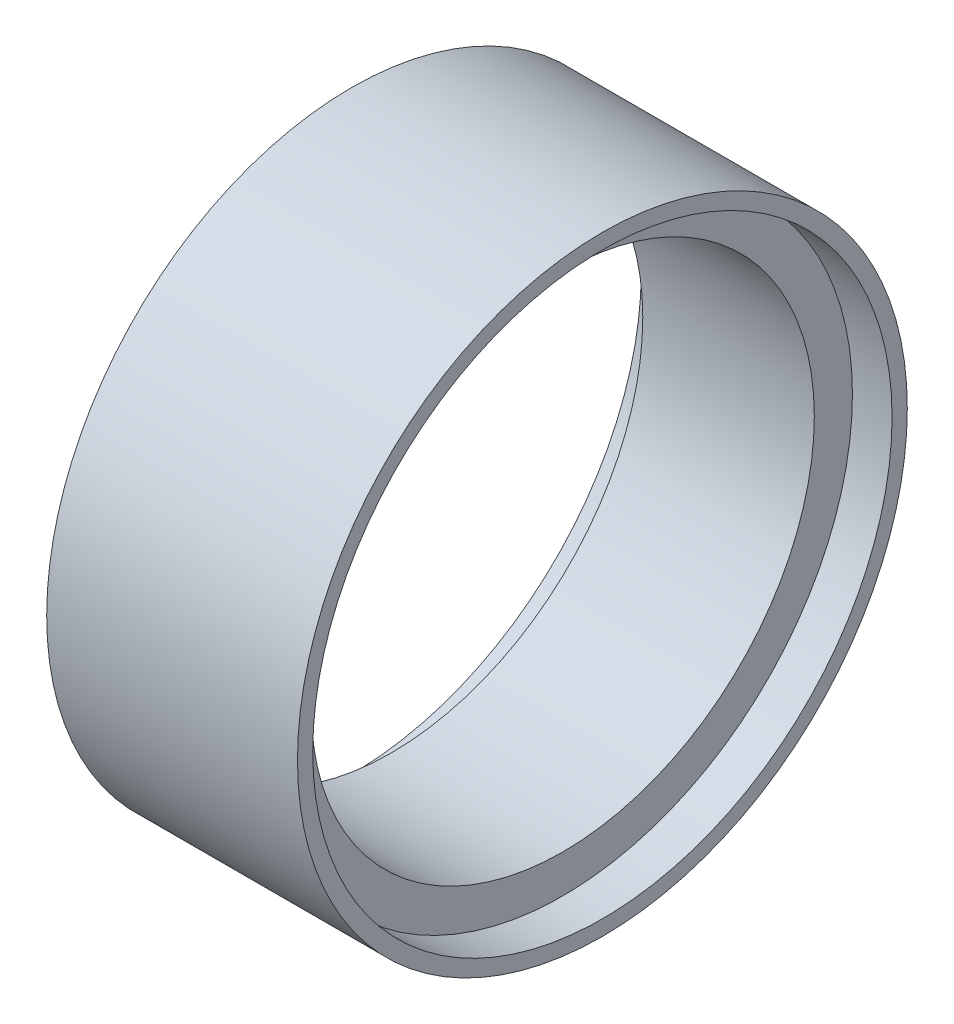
ISO-10303-21;
HEADER;
FILE_DESCRIPTION(('STEP AP214'),'2;1');
FILE_NAME('part.step','',(''),(''),'','','');
FILE_SCHEMA(('AUTOMOTIVE_DESIGN { 1 0 10303 214 1 1 1 1 }'));
ENDSEC;
DATA;
#1=APPLICATION_CONTEXT('core data for automotive mechanical design processes');
#2=APPLICATION_PROTOCOL_DEFINITION('international standard','automotive_design',2000,#1);
#3=PRODUCT_CONTEXT('',#1,'mechanical');
#4=PRODUCT('Part','Part','',(#3));
#5=PRODUCT_RELATED_PRODUCT_CATEGORY('part','',(#4));
#6=PRODUCT_DEFINITION_FORMATION('','',#4);
#7=PRODUCT_DEFINITION_CONTEXT('part definition',#1,'design');
#8=PRODUCT_DEFINITION('design','',#6,#7);
#9=PRODUCT_DEFINITION_SHAPE('','',#8);
#10=(LENGTH_UNIT() NAMED_UNIT(*) SI_UNIT(.MILLI.,.METRE.));
#11=(NAMED_UNIT(*) PLANE_ANGLE_UNIT() SI_UNIT($,.RADIAN.));
#12=(NAMED_UNIT(*) SI_UNIT($,.STERADIAN.) SOLID_ANGLE_UNIT());
#13=UNCERTAINTY_MEASURE_WITH_UNIT(LENGTH_MEASURE(1.E-05),#10,'distance_accuracy_value','');
#14=(GEOMETRIC_REPRESENTATION_CONTEXT(3) GLOBAL_UNCERTAINTY_ASSIGNED_CONTEXT((#13)) GLOBAL_UNIT_ASSIGNED_CONTEXT((#10,
#11,#12)) REPRESENTATION_CONTEXT('',''));
#15=CARTESIAN_POINT('',(0.,0.,0.));
#16=DIRECTION('',(0.,0.,1.));
#17=DIRECTION('',(1.,0.,0.));
#18=AXIS2_PLACEMENT_3D('',#15,#16,#17);
#19=CARTESIAN_POINT('',(0.,0.,0.));
#20=DIRECTION('',(-1.,0.,0.));
#21=DIRECTION('',(0.,0.,1.));
#22=AXIS2_PLACEMENT_3D('',#19,#20,#21);
#23=CYLINDRICAL_SURFACE('',#22,40.);
#24=CARTESIAN_POINT('',(0.,0.,0.));
#25=DIRECTION('',(-1.,0.,0.));
#26=DIRECTION('',(0.,0.,1.));
#27=AXIS2_PLACEMENT_3D('',#24,#25,#26);
#28=CIRCLE('',#27,40.);
#29=CARTESIAN_POINT('',(0.,0.,40.));
#30=VERTEX_POINT('',#29);
#31=EDGE_CURVE('E59',#30,#30,#28,.T.);
#32=ORIENTED_EDGE('',*,*,#31,.F.);
#33=EDGE_LOOP('',(#32));
#34=FACE_BOUND('',#33,.T.);
#35=CARTESIAN_POINT('',(32.9,0.,0.));
#36=DIRECTION('',(-1.,0.,0.));
#37=DIRECTION('',(0.,0.,1.));
#38=AXIS2_PLACEMENT_3D('',#35,#36,#37);
#39=CIRCLE('',#38,40.);
#40=CARTESIAN_POINT('',(32.9,0.,40.));
#41=VERTEX_POINT('',#40);
#42=EDGE_CURVE('E10',#41,#41,#39,.T.);
#43=ORIENTED_EDGE('',*,*,#42,.T.);
#44=EDGE_LOOP('',(#43));
#45=FACE_BOUND('',#44,.T.);
#46=ADVANCED_FACE('F31',(#34,#45),#23,.T.);
#47=CARTESIAN_POINT('',(32.9,40.,0.));
#48=DIRECTION('',(-1.,0.,0.));
#49=DIRECTION('',(0.,0.,1.));
#50=AXIS2_PLACEMENT_3D('',#47,#48,#49);
#51=PLANE('',#50);
#52=ORIENTED_EDGE('',*,*,#42,.F.);
#53=EDGE_LOOP('',(#52));
#54=FACE_BOUND('',#53,.T.);
#55=CARTESIAN_POINT('',(32.9,0.,0.));
#56=DIRECTION('',(-1.,0.,0.));
#57=DIRECTION('',(0.,0.,1.));
#58=AXIS2_PLACEMENT_3D('',#55,#56,#57);
#59=CIRCLE('',#58,38.);
#60=CARTESIAN_POINT('',(32.9,0.,38.));
#61=VERTEX_POINT('',#60);
#62=EDGE_CURVE('E37',#61,#61,#59,.T.);
#63=ORIENTED_EDGE('',*,*,#62,.T.);
#64=EDGE_LOOP('',(#63));
#65=FACE_BOUND('',#64,.T.);
#66=ADVANCED_FACE('F66',(#54,#65),#51,.F.);
#67=CARTESIAN_POINT('',(0.,0.,0.));
#68=DIRECTION('',(-1.,0.,0.));
#69=DIRECTION('',(0.,0.,1.));
#70=AXIS2_PLACEMENT_3D('',#67,#68,#69);
#71=CYLINDRICAL_SURFACE('',#70,38.);
#72=ORIENTED_EDGE('',*,*,#62,.F.);
#73=EDGE_LOOP('',(#72));
#74=FACE_BOUND('',#73,.T.);
#75=CARTESIAN_POINT('',(27.7,0.,0.));
#76=DIRECTION('',(-1.,0.,0.));
#77=DIRECTION('',(0.,0.,1.));
#78=AXIS2_PLACEMENT_3D('',#75,#76,#77);
#79=CIRCLE('',#78,38.);
#80=CARTESIAN_POINT('',(27.7,0.,38.));
#81=VERTEX_POINT('',#80);
#82=EDGE_CURVE('E41',#81,#81,#79,.T.);
#83=ORIENTED_EDGE('',*,*,#82,.T.);
#84=EDGE_LOOP('',(#83));
#85=FACE_BOUND('',#84,.T.);
#86=ADVANCED_FACE('F70',(#74,#85),#71,.F.);
#87=CARTESIAN_POINT('',(27.7,38.,0.));
#88=DIRECTION('',(-1.,0.,0.));
#89=DIRECTION('',(0.,0.,1.));
#90=AXIS2_PLACEMENT_3D('',#87,#88,#89);
#91=PLANE('',#90);
#92=ORIENTED_EDGE('',*,*,#82,.F.);
#93=EDGE_LOOP('',(#92));
#94=FACE_BOUND('',#93,.T.);
#95=CARTESIAN_POINT('',(27.7,0.,0.));
#96=DIRECTION('',(-1.,0.,0.));
#97=DIRECTION('',(0.,0.,1.));
#98=AXIS2_PLACEMENT_3D('',#95,#96,#97);
#99=CIRCLE('',#98,33.);
#100=CARTESIAN_POINT('',(27.7,0.,33.));
#101=VERTEX_POINT('',#100);
#102=EDGE_CURVE('E45',#101,#101,#99,.T.);
#103=ORIENTED_EDGE('',*,*,#102,.T.);
#104=EDGE_LOOP('',(#103));
#105=FACE_BOUND('',#104,.T.);
#106=ADVANCED_FACE('F75',(#94,#105),#91,.F.);
#107=CARTESIAN_POINT('',(0.,0.,0.));
#108=DIRECTION('',(-1.,0.,0.));
#109=DIRECTION('',(0.,0.,1.));
#110=AXIS2_PLACEMENT_3D('',#107,#108,#109);
#111=CYLINDRICAL_SURFACE('',#110,33.);
#112=ORIENTED_EDGE('',*,*,#102,.F.);
#113=EDGE_LOOP('',(#112));
#114=FACE_BOUND('',#113,.T.);
#115=CARTESIAN_POINT('',(5.20000000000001,0.,0.));
#116=DIRECTION('',(-1.,0.,0.));
#117=DIRECTION('',(0.,0.,1.));
#118=AXIS2_PLACEMENT_3D('',#115,#116,#117);
#119=CIRCLE('',#118,33.);
#120=CARTESIAN_POINT('',(5.20000000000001,0.,33.));
#121=VERTEX_POINT('',#120);
#122=EDGE_CURVE('E50',#121,#121,#119,.T.);
#123=ORIENTED_EDGE('',*,*,#122,.T.);
#124=EDGE_LOOP('',(#123));
#125=FACE_BOUND('',#124,.T.);
#126=ADVANCED_FACE('F81',(#114,#125),#111,.F.);
#127=CARTESIAN_POINT('',(5.2,33.,0.));
#128=DIRECTION('',(1.,0.,0.));
#129=DIRECTION('',(0.,0.,-1.));
#130=AXIS2_PLACEMENT_3D('',#127,#128,#129);
#131=PLANE('',#130);
#132=ORIENTED_EDGE('',*,*,#122,.F.);
#133=EDGE_LOOP('',(#132));
#134=FACE_BOUND('',#133,.T.);
#135=CARTESIAN_POINT('',(5.2,0.,0.));
#136=DIRECTION('',(-1.,0.,0.));
#137=DIRECTION('',(0.,0.,1.));
#138=AXIS2_PLACEMENT_3D('',#135,#136,#137);
#139=CIRCLE('',#138,38.);
#140=CARTESIAN_POINT('',(5.2,0.,38.));
#141=VERTEX_POINT('',#140);
#142=EDGE_CURVE('E53',#141,#141,#139,.T.);
#143=ORIENTED_EDGE('',*,*,#142,.T.);
#144=EDGE_LOOP('',(#143));
#145=FACE_BOUND('',#144,.T.);
#146=ADVANCED_FACE('F85',(#134,#145),#131,.F.);
#147=CARTESIAN_POINT('',(0.,0.,0.));
#148=DIRECTION('',(-1.,0.,0.));
#149=DIRECTION('',(0.,0.,1.));
#150=AXIS2_PLACEMENT_3D('',#147,#148,#149);
#151=CYLINDRICAL_SURFACE('',#150,38.);
#152=ORIENTED_EDGE('',*,*,#142,.F.);
#153=EDGE_LOOP('',(#152));
#154=FACE_BOUND('',#153,.T.);
#155=CARTESIAN_POINT('',(0.,0.,0.));
#156=DIRECTION('',(-1.,0.,0.));
#157=DIRECTION('',(0.,0.,1.));
#158=AXIS2_PLACEMENT_3D('',#155,#156,#157);
#159=CIRCLE('',#158,38.);
#160=CARTESIAN_POINT('',(0.,0.,38.));
#161=VERTEX_POINT('',#160);
#162=EDGE_CURVE('E56',#161,#161,#159,.T.);
#163=ORIENTED_EDGE('',*,*,#162,.T.);
#164=EDGE_LOOP('',(#163));
#165=FACE_BOUND('',#164,.T.);
#166=ADVANCED_FACE('F89',(#154,#165),#151,.F.);
#167=CARTESIAN_POINT('',(0.,38.,0.));
#168=DIRECTION('',(1.,0.,0.));
#169=DIRECTION('',(0.,0.,-1.));
#170=AXIS2_PLACEMENT_3D('',#167,#168,#169);
#171=PLANE('',#170);
#172=ORIENTED_EDGE('',*,*,#162,.F.);
#173=EDGE_LOOP('',(#172));
#174=FACE_BOUND('',#173,.T.);
#175=ORIENTED_EDGE('',*,*,#31,.T.);
#176=EDGE_LOOP('',(#175));
#177=FACE_BOUND('',#176,.T.);
#178=ADVANCED_FACE('F63',(#174,#177),#171,.F.);
#179=CLOSED_SHELL('',(#46,#66,#86,#106,#126,#146,#166,#178));
#180=MANIFOLD_SOLID_BREP('B2',#179);
#181=ADVANCED_BREP_SHAPE_REPRESENTATION('',(#18,#180),#14);
#182=SHAPE_DEFINITION_REPRESENTATION(#9,#181);
ENDSEC;
END-ISO-10303-21;
